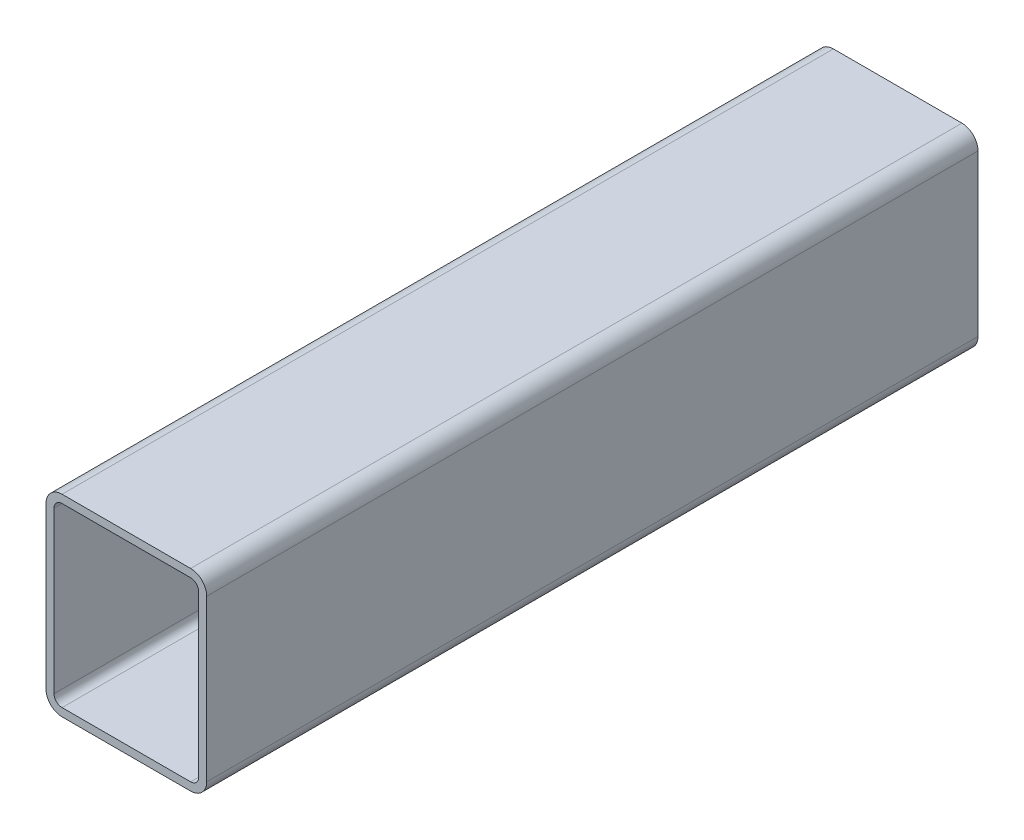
ISO-10303-21;
HEADER;
FILE_DESCRIPTION(('STEP AP214'),'2;1');
FILE_NAME('part.step','',(''),(''),'','','');
FILE_SCHEMA(('AUTOMOTIVE_DESIGN { 1 0 10303 214 1 1 1 1 }'));
ENDSEC;
DATA;
#1=APPLICATION_CONTEXT('core data for automotive mechanical design processes');
#2=APPLICATION_PROTOCOL_DEFINITION('international standard','automotive_design',2000,#1);
#3=PRODUCT_CONTEXT('',#1,'mechanical');
#4=PRODUCT('Part','Part','',(#3));
#5=PRODUCT_RELATED_PRODUCT_CATEGORY('part','',(#4));
#6=PRODUCT_DEFINITION_FORMATION('','',#4);
#7=PRODUCT_DEFINITION_CONTEXT('part definition',#1,'design');
#8=PRODUCT_DEFINITION('design','',#6,#7);
#9=PRODUCT_DEFINITION_SHAPE('','',#8);
#10=(LENGTH_UNIT() NAMED_UNIT(*) SI_UNIT(.MILLI.,.METRE.));
#11=(NAMED_UNIT(*) PLANE_ANGLE_UNIT() SI_UNIT($,.RADIAN.));
#12=(NAMED_UNIT(*) SI_UNIT($,.STERADIAN.) SOLID_ANGLE_UNIT());
#13=UNCERTAINTY_MEASURE_WITH_UNIT(LENGTH_MEASURE(1.E-05),#10,'distance_accuracy_value','');
#14=(GEOMETRIC_REPRESENTATION_CONTEXT(3) GLOBAL_UNCERTAINTY_ASSIGNED_CONTEXT((#13)) GLOBAL_UNIT_ASSIGNED_CONTEXT((#10,
#11,#12)) REPRESENTATION_CONTEXT('',''));
#15=CARTESIAN_POINT('',(0.,0.,0.));
#16=DIRECTION('',(0.,0.,1.));
#17=DIRECTION('',(1.,0.,0.));
#18=AXIS2_PLACEMENT_3D('',#15,#16,#17);
#19=CARTESIAN_POINT('',(9.24608514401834,71.9306737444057,304.8));
#20=DIRECTION('',(0.,0.,1.));
#21=DIRECTION('',(1.,0.,0.));
#22=AXIS2_PLACEMENT_3D('',#19,#20,#21);
#23=PLANE('',#22);
#24=CARTESIAN_POINT('',(9.24608514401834,71.9306737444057,304.8));
#25=DIRECTION('',(0.,0.,1.));
#26=DIRECTION('',(1.,0.,0.));
#27=AXIS2_PLACEMENT_3D('',#24,#25,#26);
#28=CIRCLE('',#27,6.35);
#29=CARTESIAN_POINT('',(9.24608514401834,78.2806737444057,304.8));
#30=VERTEX_POINT('',#29);
#31=CARTESIAN_POINT('',(2.89608514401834,71.9306737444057,304.8));
#32=VERTEX_POINT('',#31);
#33=EDGE_CURVE('E211',#30,#32,#28,.T.);
#34=ORIENTED_EDGE('',*,*,#33,.T.);
#35=DIRECTION('',(0.,-1.,0.));
#36=VECTOR('',#35,1.);
#37=CARTESIAN_POINT('',(2.89608514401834,8.4306737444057,304.8));
#38=LINE('',#37,#36);
#39=CARTESIAN_POINT('',(2.89608514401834,8.4306737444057,304.8));
#40=VERTEX_POINT('',#39);
#41=EDGE_CURVE('E214',#32,#40,#38,.T.);
#42=ORIENTED_EDGE('',*,*,#41,.T.);
#43=CARTESIAN_POINT('',(9.24608514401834,8.4306737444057,304.8));
#44=DIRECTION('',(0.,0.,1.));
#45=DIRECTION('',(1.,0.,0.));
#46=AXIS2_PLACEMENT_3D('',#43,#44,#45);
#47=CIRCLE('',#46,6.35);
#48=CARTESIAN_POINT('',(9.24608514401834,2.0806737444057,304.8));
#49=VERTEX_POINT('',#48);
#50=EDGE_CURVE('E217',#40,#49,#47,.T.);
#51=ORIENTED_EDGE('',*,*,#50,.T.);
#52=DIRECTION('',(1.,0.,0.));
#53=VECTOR('',#52,1.);
#54=CARTESIAN_POINT('',(60.0460851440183,2.0806737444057,304.8));
#55=LINE('',#54,#53);
#56=CARTESIAN_POINT('',(60.0460851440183,2.0806737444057,304.8));
#57=VERTEX_POINT('',#56);
#58=EDGE_CURVE('E219',#49,#57,#55,.T.);
#59=ORIENTED_EDGE('',*,*,#58,.T.);
#60=CARTESIAN_POINT('',(60.0460851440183,8.4306737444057,304.8));
#61=DIRECTION('',(0.,0.,1.));
#62=DIRECTION('',(1.,0.,0.));
#63=AXIS2_PLACEMENT_3D('',#60,#61,#62);
#64=CIRCLE('',#63,6.35);
#65=CARTESIAN_POINT('',(66.3960851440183,8.4306737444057,304.8));
#66=VERTEX_POINT('',#65);
#67=EDGE_CURVE('E221',#57,#66,#64,.T.);
#68=ORIENTED_EDGE('',*,*,#67,.T.);
#69=DIRECTION('',(0.,1.,0.));
#70=VECTOR('',#69,1.);
#71=CARTESIAN_POINT('',(66.3960851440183,71.9306737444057,304.8));
#72=LINE('',#71,#70);
#73=CARTESIAN_POINT('',(66.3960851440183,71.9306737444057,304.8));
#74=VERTEX_POINT('',#73);
#75=EDGE_CURVE('E223',#66,#74,#72,.T.);
#76=ORIENTED_EDGE('',*,*,#75,.T.);
#77=CARTESIAN_POINT('',(60.0460851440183,71.9306737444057,304.8));
#78=DIRECTION('',(0.,0.,1.));
#79=DIRECTION('',(1.,0.,0.));
#80=AXIS2_PLACEMENT_3D('',#77,#78,#79);
#81=CIRCLE('',#80,6.35);
#82=CARTESIAN_POINT('',(60.0460851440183,78.2806737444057,304.8));
#83=VERTEX_POINT('',#82);
#84=EDGE_CURVE('E225',#74,#83,#81,.T.);
#85=ORIENTED_EDGE('',*,*,#84,.T.);
#86=DIRECTION('',(-1.,0.,0.));
#87=VECTOR('',#86,1.);
#88=CARTESIAN_POINT('',(9.24608514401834,78.2806737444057,304.8));
#89=LINE('',#88,#87);
#90=EDGE_CURVE('E227',#83,#30,#89,.T.);
#91=ORIENTED_EDGE('',*,*,#90,.T.);
#92=EDGE_LOOP('',(#34,#42,#51,#59,#68,#76,#85,#91));
#93=FACE_BOUND('',#92,.T.);
#94=DIRECTION('',(0.,-1.,0.));
#95=VECTOR('',#94,1.);
#96=CARTESIAN_POINT('',(6.07108514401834,8.4306737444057,304.8));
#97=LINE('',#96,#95);
#98=CARTESIAN_POINT('',(6.07108514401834,71.9306737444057,304.8));
#99=VERTEX_POINT('',#98);
#100=CARTESIAN_POINT('',(6.07108514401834,8.4306737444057,304.8));
#101=VERTEX_POINT('',#100);
#102=EDGE_CURVE('E154',#99,#101,#97,.T.);
#103=ORIENTED_EDGE('',*,*,#102,.F.);
#104=CARTESIAN_POINT('',(9.24608514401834,71.9306737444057,304.8));
#105=DIRECTION('',(0.,0.,1.));
#106=DIRECTION('',(1.,0.,0.));
#107=AXIS2_PLACEMENT_3D('',#104,#105,#106);
#108=CIRCLE('',#107,3.175);
#109=CARTESIAN_POINT('',(9.24608514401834,75.1056737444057,304.8));
#110=VERTEX_POINT('',#109);
#111=EDGE_CURVE('E146',#110,#99,#108,.T.);
#112=ORIENTED_EDGE('',*,*,#111,.F.);
#113=DIRECTION('',(-1.,0.,0.));
#114=VECTOR('',#113,1.);
#115=CARTESIAN_POINT('',(9.24608514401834,75.1056737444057,304.8));
#116=LINE('',#115,#114);
#117=CARTESIAN_POINT('',(60.0460851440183,75.1056737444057,304.8));
#118=VERTEX_POINT('',#117);
#119=EDGE_CURVE('E179',#118,#110,#116,.T.);
#120=ORIENTED_EDGE('',*,*,#119,.F.);
#121=CARTESIAN_POINT('',(60.0460851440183,71.9306737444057,304.8));
#122=DIRECTION('',(0.,0.,1.));
#123=DIRECTION('',(1.,0.,0.));
#124=AXIS2_PLACEMENT_3D('',#121,#122,#123);
#125=CIRCLE('',#124,3.175);
#126=CARTESIAN_POINT('',(63.2210851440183,71.9306737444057,304.8));
#127=VERTEX_POINT('',#126);
#128=EDGE_CURVE('E177',#127,#118,#125,.T.);
#129=ORIENTED_EDGE('',*,*,#128,.F.);
#130=DIRECTION('',(0.,1.,0.));
#131=VECTOR('',#130,1.);
#132=CARTESIAN_POINT('',(63.2210851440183,71.9306737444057,304.8));
#133=LINE('',#132,#131);
#134=CARTESIAN_POINT('',(63.2210851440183,8.4306737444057,304.8));
#135=VERTEX_POINT('',#134);
#136=EDGE_CURVE('E175',#135,#127,#133,.T.);
#137=ORIENTED_EDGE('',*,*,#136,.F.);
#138=CARTESIAN_POINT('',(60.0460851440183,8.4306737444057,304.8));
#139=DIRECTION('',(0.,0.,1.));
#140=DIRECTION('',(1.,0.,0.));
#141=AXIS2_PLACEMENT_3D('',#138,#139,#140);
#142=CIRCLE('',#141,3.175);
#143=CARTESIAN_POINT('',(60.0460851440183,5.2556737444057,304.8));
#144=VERTEX_POINT('',#143);
#145=EDGE_CURVE('E173',#144,#135,#142,.T.);
#146=ORIENTED_EDGE('',*,*,#145,.F.);
#147=DIRECTION('',(1.,0.,0.));
#148=VECTOR('',#147,1.);
#149=CARTESIAN_POINT('',(60.0460851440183,5.2556737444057,304.8));
#150=LINE('',#149,#148);
#151=CARTESIAN_POINT('',(9.24608514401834,5.2556737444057,304.8));
#152=VERTEX_POINT('',#151);
#153=EDGE_CURVE('E169',#152,#144,#150,.T.);
#154=ORIENTED_EDGE('',*,*,#153,.F.);
#155=CARTESIAN_POINT('',(9.24608514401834,8.4306737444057,304.8));
#156=DIRECTION('',(0.,0.,1.));
#157=DIRECTION('',(1.,0.,0.));
#158=AXIS2_PLACEMENT_3D('',#155,#156,#157);
#159=CIRCLE('',#158,3.175);
#160=EDGE_CURVE('E167',#101,#152,#159,.T.);
#161=ORIENTED_EDGE('',*,*,#160,.F.);
#162=EDGE_LOOP('',(#103,#112,#120,#129,#137,#146,#154,#161));
#163=FACE_BOUND('',#162,.T.);
#164=ADVANCED_FACE('F33',(#93,#163),#23,.T.);
#165=CARTESIAN_POINT('',(9.24608514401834,71.9306737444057,0.));
#166=DIRECTION('',(0.,0.,1.));
#167=DIRECTION('',(1.,0.,0.));
#168=AXIS2_PLACEMENT_3D('',#165,#166,#167);
#169=PLANE('',#168);
#170=CARTESIAN_POINT('',(9.24608514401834,71.9306737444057,0.));
#171=DIRECTION('',(0.,0.,1.));
#172=DIRECTION('',(1.,0.,0.));
#173=AXIS2_PLACEMENT_3D('',#170,#171,#172);
#174=CIRCLE('',#173,6.35);
#175=CARTESIAN_POINT('',(9.24608514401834,78.2806737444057,0.));
#176=VERTEX_POINT('',#175);
#177=CARTESIAN_POINT('',(2.89608514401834,71.9306737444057,0.));
#178=VERTEX_POINT('',#177);
#179=EDGE_CURVE('E162',#176,#178,#174,.T.);
#180=ORIENTED_EDGE('',*,*,#179,.F.);
#181=DIRECTION('',(-1.,0.,0.));
#182=VECTOR('',#181,1.);
#183=CARTESIAN_POINT('',(9.24608514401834,78.2806737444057,0.));
#184=LINE('',#183,#182);
#185=CARTESIAN_POINT('',(60.0460851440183,78.2806737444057,0.));
#186=VERTEX_POINT('',#185);
#187=EDGE_CURVE('E215',#186,#176,#184,.T.);
#188=ORIENTED_EDGE('',*,*,#187,.F.);
#189=CARTESIAN_POINT('',(60.0460851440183,71.9306737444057,0.));
#190=DIRECTION('',(0.,0.,1.));
#191=DIRECTION('',(1.,0.,0.));
#192=AXIS2_PLACEMENT_3D('',#189,#190,#191);
#193=CIRCLE('',#192,6.35);
#194=CARTESIAN_POINT('',(66.3960851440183,71.9306737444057,0.));
#195=VERTEX_POINT('',#194);
#196=EDGE_CURVE('E242',#195,#186,#193,.T.);
#197=ORIENTED_EDGE('',*,*,#196,.F.);
#198=DIRECTION('',(0.,1.,0.));
#199=VECTOR('',#198,1.);
#200=CARTESIAN_POINT('',(66.3960851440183,71.9306737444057,0.));
#201=LINE('',#200,#199);
#202=CARTESIAN_POINT('',(66.3960851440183,8.4306737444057,0.));
#203=VERTEX_POINT('',#202);
#204=EDGE_CURVE('E240',#203,#195,#201,.T.);
#205=ORIENTED_EDGE('',*,*,#204,.F.);
#206=CARTESIAN_POINT('',(60.0460851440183,8.4306737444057,0.));
#207=DIRECTION('',(0.,0.,1.));
#208=DIRECTION('',(1.,0.,0.));
#209=AXIS2_PLACEMENT_3D('',#206,#207,#208);
#210=CIRCLE('',#209,6.35);
#211=CARTESIAN_POINT('',(60.0460851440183,2.0806737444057,0.));
#212=VERTEX_POINT('',#211);
#213=EDGE_CURVE('E238',#212,#203,#210,.T.);
#214=ORIENTED_EDGE('',*,*,#213,.F.);
#215=DIRECTION('',(1.,0.,0.));
#216=VECTOR('',#215,1.);
#217=CARTESIAN_POINT('',(60.0460851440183,2.0806737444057,0.));
#218=LINE('',#217,#216);
#219=CARTESIAN_POINT('',(9.24608514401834,2.0806737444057,0.));
#220=VERTEX_POINT('',#219);
#221=EDGE_CURVE('E236',#220,#212,#218,.T.);
#222=ORIENTED_EDGE('',*,*,#221,.F.);
#223=CARTESIAN_POINT('',(9.24608514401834,8.4306737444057,0.));
#224=DIRECTION('',(0.,0.,1.));
#225=DIRECTION('',(1.,0.,0.));
#226=AXIS2_PLACEMENT_3D('',#223,#224,#225);
#227=CIRCLE('',#226,6.35);
#228=CARTESIAN_POINT('',(2.89608514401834,8.4306737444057,0.));
#229=VERTEX_POINT('',#228);
#230=EDGE_CURVE('E234',#229,#220,#227,.T.);
#231=ORIENTED_EDGE('',*,*,#230,.F.);
#232=DIRECTION('',(0.,-1.,0.));
#233=VECTOR('',#232,1.);
#234=CARTESIAN_POINT('',(2.89608514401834,8.4306737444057,0.));
#235=LINE('',#234,#233);
#236=EDGE_CURVE('E232',#178,#229,#235,.T.);
#237=ORIENTED_EDGE('',*,*,#236,.F.);
#238=EDGE_LOOP('',(#180,#188,#197,#205,#214,#222,#231,#237));
#239=FACE_BOUND('',#238,.T.);
#240=CARTESIAN_POINT('',(9.24608514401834,71.9306737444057,0.));
#241=DIRECTION('',(0.,0.,1.));
#242=DIRECTION('',(1.,0.,0.));
#243=AXIS2_PLACEMENT_3D('',#240,#241,#242);
#244=CIRCLE('',#243,3.175);
#245=CARTESIAN_POINT('',(9.24608514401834,75.1056737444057,0.));
#246=VERTEX_POINT('',#245);
#247=CARTESIAN_POINT('',(6.07108514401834,71.9306737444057,0.));
#248=VERTEX_POINT('',#247);
#249=EDGE_CURVE('E56',#246,#248,#244,.T.);
#250=ORIENTED_EDGE('',*,*,#249,.T.);
#251=DIRECTION('',(0.,-1.,0.));
#252=VECTOR('',#251,1.);
#253=CARTESIAN_POINT('',(6.07108514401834,8.4306737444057,0.));
#254=LINE('',#253,#252);
#255=CARTESIAN_POINT('',(6.07108514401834,8.4306737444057,0.));
#256=VERTEX_POINT('',#255);
#257=EDGE_CURVE('E161',#248,#256,#254,.T.);
#258=ORIENTED_EDGE('',*,*,#257,.T.);
#259=CARTESIAN_POINT('',(9.24608514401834,8.4306737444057,0.));
#260=DIRECTION('',(0.,0.,1.));
#261=DIRECTION('',(1.,0.,0.));
#262=AXIS2_PLACEMENT_3D('',#259,#260,#261);
#263=CIRCLE('',#262,3.175);
#264=CARTESIAN_POINT('',(9.24608514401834,5.2556737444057,0.));
#265=VERTEX_POINT('',#264);
#266=EDGE_CURVE('E183',#256,#265,#263,.T.);
#267=ORIENTED_EDGE('',*,*,#266,.T.);
#268=DIRECTION('',(1.,0.,0.));
#269=VECTOR('',#268,1.);
#270=CARTESIAN_POINT('',(60.0460851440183,5.2556737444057,0.));
#271=LINE('',#270,#269);
#272=CARTESIAN_POINT('',(60.0460851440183,5.2556737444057,0.));
#273=VERTEX_POINT('',#272);
#274=EDGE_CURVE('E186',#265,#273,#271,.T.);
#275=ORIENTED_EDGE('',*,*,#274,.T.);
#276=CARTESIAN_POINT('',(60.0460851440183,8.4306737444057,0.));
#277=DIRECTION('',(0.,0.,1.));
#278=DIRECTION('',(1.,0.,0.));
#279=AXIS2_PLACEMENT_3D('',#276,#277,#278);
#280=CIRCLE('',#279,3.175);
#281=CARTESIAN_POINT('',(63.2210851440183,8.4306737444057,0.));
#282=VERTEX_POINT('',#281);
#283=EDGE_CURVE('E189',#273,#282,#280,.T.);
#284=ORIENTED_EDGE('',*,*,#283,.T.);
#285=DIRECTION('',(0.,1.,0.));
#286=VECTOR('',#285,1.);
#287=CARTESIAN_POINT('',(63.2210851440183,71.9306737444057,0.));
#288=LINE('',#287,#286);
#289=CARTESIAN_POINT('',(63.2210851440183,71.9306737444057,0.));
#290=VERTEX_POINT('',#289);
#291=EDGE_CURVE('E192',#282,#290,#288,.T.);
#292=ORIENTED_EDGE('',*,*,#291,.T.);
#293=CARTESIAN_POINT('',(60.0460851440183,71.9306737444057,0.));
#294=DIRECTION('',(0.,0.,1.));
#295=DIRECTION('',(1.,0.,0.));
#296=AXIS2_PLACEMENT_3D('',#293,#294,#295);
#297=CIRCLE('',#296,3.175);
#298=CARTESIAN_POINT('',(60.0460851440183,75.1056737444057,0.));
#299=VERTEX_POINT('',#298);
#300=EDGE_CURVE('E195',#290,#299,#297,.T.);
#301=ORIENTED_EDGE('',*,*,#300,.T.);
#302=DIRECTION('',(-1.,0.,0.));
#303=VECTOR('',#302,1.);
#304=CARTESIAN_POINT('',(9.24608514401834,75.1056737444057,0.));
#305=LINE('',#304,#303);
#306=EDGE_CURVE('E155',#299,#246,#305,.T.);
#307=ORIENTED_EDGE('',*,*,#306,.T.);
#308=EDGE_LOOP('',(#250,#258,#267,#275,#284,#292,#301,#307));
#309=FACE_BOUND('',#308,.T.);
#310=ADVANCED_FACE('F272',(#239,#309),#169,.F.);
#311=CARTESIAN_POINT('',(9.24608514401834,71.9306737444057,304.8));
#312=DIRECTION('',(0.,0.,-1.));
#313=DIRECTION('',(-1.,0.,0.));
#314=AXIS2_PLACEMENT_3D('',#311,#312,#313);
#315=CYLINDRICAL_SURFACE('',#314,6.35);
#316=ORIENTED_EDGE('',*,*,#179,.T.);
#317=DIRECTION('',(0.,0.,-1.));
#318=VECTOR('',#317,1.);
#319=CARTESIAN_POINT('',(2.89608514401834,71.9306737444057,304.8));
#320=LINE('',#319,#318);
#321=EDGE_CURVE('E11',#32,#178,#320,.T.);
#322=ORIENTED_EDGE('',*,*,#321,.F.);
#323=ORIENTED_EDGE('',*,*,#33,.F.);
#324=DIRECTION('',(0.,0.,-1.));
#325=VECTOR('',#324,1.);
#326=CARTESIAN_POINT('',(9.24608514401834,78.2806737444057,304.8));
#327=LINE('',#326,#325);
#328=EDGE_CURVE('E229',#30,#176,#327,.T.);
#329=ORIENTED_EDGE('',*,*,#328,.T.);
#330=EDGE_LOOP('',(#316,#322,#323,#329));
#331=FACE_BOUND('',#330,.T.);
#332=ADVANCED_FACE('F35',(#331),#315,.T.);
#333=CARTESIAN_POINT('',(2.89608514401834,8.4306737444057,304.8));
#334=DIRECTION('',(1.,0.,0.));
#335=DIRECTION('',(0.,0.,-1.));
#336=AXIS2_PLACEMENT_3D('',#333,#334,#335);
#337=PLANE('',#336);
#338=ORIENTED_EDGE('',*,*,#236,.T.);
#339=DIRECTION('',(0.,0.,-1.));
#340=VECTOR('',#339,1.);
#341=CARTESIAN_POINT('',(2.89608514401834,8.4306737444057,304.8));
#342=LINE('',#341,#340);
#343=EDGE_CURVE('E41',#40,#229,#342,.T.);
#344=ORIENTED_EDGE('',*,*,#343,.F.);
#345=ORIENTED_EDGE('',*,*,#41,.F.);
#346=ORIENTED_EDGE('',*,*,#321,.T.);
#347=EDGE_LOOP('',(#338,#344,#345,#346));
#348=FACE_BOUND('',#347,.T.);
#349=ADVANCED_FACE('F289',(#348),#337,.F.);
#350=CARTESIAN_POINT('',(9.24608514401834,8.4306737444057,304.8));
#351=DIRECTION('',(0.,0.,-1.));
#352=DIRECTION('',(-1.,0.,0.));
#353=AXIS2_PLACEMENT_3D('',#350,#351,#352);
#354=CYLINDRICAL_SURFACE('',#353,6.35);
#355=ORIENTED_EDGE('',*,*,#230,.T.);
#356=DIRECTION('',(0.,0.,-1.));
#357=VECTOR('',#356,1.);
#358=CARTESIAN_POINT('',(9.24608514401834,2.0806737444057,304.8));
#359=LINE('',#358,#357);
#360=EDGE_CURVE('E259',#49,#220,#359,.T.);
#361=ORIENTED_EDGE('',*,*,#360,.F.);
#362=ORIENTED_EDGE('',*,*,#50,.F.);
#363=ORIENTED_EDGE('',*,*,#343,.T.);
#364=EDGE_LOOP('',(#355,#361,#362,#363));
#365=FACE_BOUND('',#364,.T.);
#366=ADVANCED_FACE('F266',(#365),#354,.T.);
#367=CARTESIAN_POINT('',(60.0460851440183,2.0806737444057,304.8));
#368=DIRECTION('',(0.,1.,0.));
#369=DIRECTION('',(0.,0.,1.));
#370=AXIS2_PLACEMENT_3D('',#367,#368,#369);
#371=PLANE('',#370);
#372=ORIENTED_EDGE('',*,*,#221,.T.);
#373=DIRECTION('',(0.,0.,-1.));
#374=VECTOR('',#373,1.);
#375=CARTESIAN_POINT('',(60.0460851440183,2.0806737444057,304.8));
#376=LINE('',#375,#374);
#377=EDGE_CURVE('E256',#57,#212,#376,.T.);
#378=ORIENTED_EDGE('',*,*,#377,.F.);
#379=ORIENTED_EDGE('',*,*,#58,.F.);
#380=ORIENTED_EDGE('',*,*,#360,.T.);
#381=EDGE_LOOP('',(#372,#378,#379,#380));
#382=FACE_BOUND('',#381,.T.);
#383=ADVANCED_FACE('F278',(#382),#371,.F.);
#384=CARTESIAN_POINT('',(60.0460851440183,8.4306737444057,304.8));
#385=DIRECTION('',(0.,0.,-1.));
#386=DIRECTION('',(-1.,0.,0.));
#387=AXIS2_PLACEMENT_3D('',#384,#385,#386);
#388=CYLINDRICAL_SURFACE('',#387,6.35);
#389=ORIENTED_EDGE('',*,*,#213,.T.);
#390=DIRECTION('',(0.,0.,-1.));
#391=VECTOR('',#390,1.);
#392=CARTESIAN_POINT('',(66.3960851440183,8.4306737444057,304.8));
#393=LINE('',#392,#391);
#394=EDGE_CURVE('E253',#66,#203,#393,.T.);
#395=ORIENTED_EDGE('',*,*,#394,.F.);
#396=ORIENTED_EDGE('',*,*,#67,.F.);
#397=ORIENTED_EDGE('',*,*,#377,.T.);
#398=EDGE_LOOP('',(#389,#395,#396,#397));
#399=FACE_BOUND('',#398,.T.);
#400=ADVANCED_FACE('F282',(#399),#388,.T.);
#401=CARTESIAN_POINT('',(66.3960851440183,71.9306737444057,304.8));
#402=DIRECTION('',(-1.,0.,0.));
#403=DIRECTION('',(0.,0.,1.));
#404=AXIS2_PLACEMENT_3D('',#401,#402,#403);
#405=PLANE('',#404);
#406=ORIENTED_EDGE('',*,*,#204,.T.);
#407=DIRECTION('',(0.,0.,-1.));
#408=VECTOR('',#407,1.);
#409=CARTESIAN_POINT('',(66.3960851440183,71.9306737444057,304.8));
#410=LINE('',#409,#408);
#411=EDGE_CURVE('E250',#74,#195,#410,.T.);
#412=ORIENTED_EDGE('',*,*,#411,.F.);
#413=ORIENTED_EDGE('',*,*,#75,.F.);
#414=ORIENTED_EDGE('',*,*,#394,.T.);
#415=EDGE_LOOP('',(#406,#412,#413,#414));
#416=FACE_BOUND('',#415,.T.);
#417=ADVANCED_FACE('F302',(#416),#405,.F.);
#418=CARTESIAN_POINT('',(60.0460851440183,71.9306737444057,304.8));
#419=DIRECTION('',(0.,0.,-1.));
#420=DIRECTION('',(-1.,0.,0.));
#421=AXIS2_PLACEMENT_3D('',#418,#419,#420);
#422=CYLINDRICAL_SURFACE('',#421,6.35);
#423=ORIENTED_EDGE('',*,*,#196,.T.);
#424=DIRECTION('',(0.,0.,-1.));
#425=VECTOR('',#424,1.);
#426=CARTESIAN_POINT('',(60.0460851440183,78.2806737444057,304.8));
#427=LINE('',#426,#425);
#428=EDGE_CURVE('E247',#83,#186,#427,.T.);
#429=ORIENTED_EDGE('',*,*,#428,.F.);
#430=ORIENTED_EDGE('',*,*,#84,.F.);
#431=ORIENTED_EDGE('',*,*,#411,.T.);
#432=EDGE_LOOP('',(#423,#429,#430,#431));
#433=FACE_BOUND('',#432,.T.);
#434=ADVANCED_FACE('F300',(#433),#422,.T.);
#435=CARTESIAN_POINT('',(9.24608514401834,78.2806737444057,304.8));
#436=DIRECTION('',(0.,-1.,0.));
#437=DIRECTION('',(0.,0.,-1.));
#438=AXIS2_PLACEMENT_3D('',#435,#436,#437);
#439=PLANE('',#438);
#440=ORIENTED_EDGE('',*,*,#187,.T.);
#441=ORIENTED_EDGE('',*,*,#328,.F.);
#442=ORIENTED_EDGE('',*,*,#90,.F.);
#443=ORIENTED_EDGE('',*,*,#428,.T.);
#444=EDGE_LOOP('',(#440,#441,#442,#443));
#445=FACE_BOUND('',#444,.T.);
#446=ADVANCED_FACE('F295',(#445),#439,.F.);
#447=CARTESIAN_POINT('',(9.24608514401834,71.9306737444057,304.8));
#448=DIRECTION('',(0.,0.,-1.));
#449=DIRECTION('',(-1.,0.,0.));
#450=AXIS2_PLACEMENT_3D('',#447,#448,#449);
#451=CYLINDRICAL_SURFACE('',#450,3.175);
#452=ORIENTED_EDGE('',*,*,#249,.F.);
#453=DIRECTION('',(0.,0.,-1.));
#454=VECTOR('',#453,1.);
#455=CARTESIAN_POINT('',(9.24608514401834,75.1056737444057,304.8));
#456=LINE('',#455,#454);
#457=EDGE_CURVE('E150',#110,#246,#456,.T.);
#458=ORIENTED_EDGE('',*,*,#457,.F.);
#459=ORIENTED_EDGE('',*,*,#111,.T.);
#460=DIRECTION('',(0.,0.,-1.));
#461=VECTOR('',#460,1.);
#462=CARTESIAN_POINT('',(6.07108514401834,71.9306737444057,304.8));
#463=LINE('',#462,#461);
#464=EDGE_CURVE('E149',#99,#248,#463,.T.);
#465=ORIENTED_EDGE('',*,*,#464,.T.);
#466=EDGE_LOOP('',(#452,#458,#459,#465));
#467=FACE_BOUND('',#466,.T.);
#468=ADVANCED_FACE('F148',(#467),#451,.F.);
#469=CARTESIAN_POINT('',(6.07108514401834,8.4306737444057,304.8));
#470=DIRECTION('',(1.,0.,0.));
#471=DIRECTION('',(0.,0.,-1.));
#472=AXIS2_PLACEMENT_3D('',#469,#470,#471);
#473=PLANE('',#472);
#474=ORIENTED_EDGE('',*,*,#257,.F.);
#475=ORIENTED_EDGE('',*,*,#464,.F.);
#476=ORIENTED_EDGE('',*,*,#102,.T.);
#477=DIRECTION('',(0.,0.,-1.));
#478=VECTOR('',#477,1.);
#479=CARTESIAN_POINT('',(6.07108514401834,8.4306737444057,304.8));
#480=LINE('',#479,#478);
#481=EDGE_CURVE('E163',#101,#256,#480,.T.);
#482=ORIENTED_EDGE('',*,*,#481,.T.);
#483=EDGE_LOOP('',(#474,#475,#476,#482));
#484=FACE_BOUND('',#483,.T.);
#485=ADVANCED_FACE('F158',(#484),#473,.T.);
#486=CARTESIAN_POINT('',(9.24608514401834,8.4306737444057,304.8));
#487=DIRECTION('',(0.,0.,-1.));
#488=DIRECTION('',(-1.,0.,0.));
#489=AXIS2_PLACEMENT_3D('',#486,#487,#488);
#490=CYLINDRICAL_SURFACE('',#489,3.175);
#491=ORIENTED_EDGE('',*,*,#266,.F.);
#492=ORIENTED_EDGE('',*,*,#481,.F.);
#493=ORIENTED_EDGE('',*,*,#160,.T.);
#494=DIRECTION('',(0.,0.,-1.));
#495=VECTOR('',#494,1.);
#496=CARTESIAN_POINT('',(9.24608514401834,5.2556737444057,304.8));
#497=LINE('',#496,#495);
#498=EDGE_CURVE('E208',#152,#265,#497,.T.);
#499=ORIENTED_EDGE('',*,*,#498,.T.);
#500=EDGE_LOOP('',(#491,#492,#493,#499));
#501=FACE_BOUND('',#500,.T.);
#502=ADVANCED_FACE('F327',(#501),#490,.F.);
#503=CARTESIAN_POINT('',(60.0460851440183,5.2556737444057,304.8));
#504=DIRECTION('',(0.,1.,0.));
#505=DIRECTION('',(0.,0.,1.));
#506=AXIS2_PLACEMENT_3D('',#503,#504,#505);
#507=PLANE('',#506);
#508=ORIENTED_EDGE('',*,*,#274,.F.);
#509=ORIENTED_EDGE('',*,*,#498,.F.);
#510=ORIENTED_EDGE('',*,*,#153,.T.);
#511=DIRECTION('',(0.,0.,-1.));
#512=VECTOR('',#511,1.);
#513=CARTESIAN_POINT('',(60.0460851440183,5.2556737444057,304.8));
#514=LINE('',#513,#512);
#515=EDGE_CURVE('E206',#144,#273,#514,.T.);
#516=ORIENTED_EDGE('',*,*,#515,.T.);
#517=EDGE_LOOP('',(#508,#509,#510,#516));
#518=FACE_BOUND('',#517,.T.);
#519=ADVANCED_FACE('F331',(#518),#507,.T.);
#520=CARTESIAN_POINT('',(60.0460851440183,8.4306737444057,304.8));
#521=DIRECTION('',(0.,0.,-1.));
#522=DIRECTION('',(-1.,0.,0.));
#523=AXIS2_PLACEMENT_3D('',#520,#521,#522);
#524=CYLINDRICAL_SURFACE('',#523,3.175);
#525=ORIENTED_EDGE('',*,*,#283,.F.);
#526=ORIENTED_EDGE('',*,*,#515,.F.);
#527=ORIENTED_EDGE('',*,*,#145,.T.);
#528=DIRECTION('',(0.,0.,-1.));
#529=VECTOR('',#528,1.);
#530=CARTESIAN_POINT('',(63.2210851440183,8.4306737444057,304.8));
#531=LINE('',#530,#529);
#532=EDGE_CURVE('E204',#135,#282,#531,.T.);
#533=ORIENTED_EDGE('',*,*,#532,.T.);
#534=EDGE_LOOP('',(#525,#526,#527,#533));
#535=FACE_BOUND('',#534,.T.);
#536=ADVANCED_FACE('F337',(#535),#524,.F.);
#537=CARTESIAN_POINT('',(63.2210851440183,71.9306737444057,304.8));
#538=DIRECTION('',(-1.,0.,0.));
#539=DIRECTION('',(0.,0.,1.));
#540=AXIS2_PLACEMENT_3D('',#537,#538,#539);
#541=PLANE('',#540);
#542=ORIENTED_EDGE('',*,*,#291,.F.);
#543=ORIENTED_EDGE('',*,*,#532,.F.);
#544=ORIENTED_EDGE('',*,*,#136,.T.);
#545=DIRECTION('',(0.,0.,-1.));
#546=VECTOR('',#545,1.);
#547=CARTESIAN_POINT('',(63.2210851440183,71.9306737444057,304.8));
#548=LINE('',#547,#546);
#549=EDGE_CURVE('E202',#127,#290,#548,.T.);
#550=ORIENTED_EDGE('',*,*,#549,.T.);
#551=EDGE_LOOP('',(#542,#543,#544,#550));
#552=FACE_BOUND('',#551,.T.);
#553=ADVANCED_FACE('F341',(#552),#541,.T.);
#554=CARTESIAN_POINT('',(60.0460851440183,71.9306737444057,304.8));
#555=DIRECTION('',(0.,0.,-1.));
#556=DIRECTION('',(-1.,0.,0.));
#557=AXIS2_PLACEMENT_3D('',#554,#555,#556);
#558=CYLINDRICAL_SURFACE('',#557,3.175);
#559=ORIENTED_EDGE('',*,*,#300,.F.);
#560=ORIENTED_EDGE('',*,*,#549,.F.);
#561=ORIENTED_EDGE('',*,*,#128,.T.);
#562=DIRECTION('',(0.,0.,-1.));
#563=VECTOR('',#562,1.);
#564=CARTESIAN_POINT('',(60.0460851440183,75.1056737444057,304.8));
#565=LINE('',#564,#563);
#566=EDGE_CURVE('E48',#118,#299,#565,.T.);
#567=ORIENTED_EDGE('',*,*,#566,.T.);
#568=EDGE_LOOP('',(#559,#560,#561,#567));
#569=FACE_BOUND('',#568,.T.);
#570=ADVANCED_FACE('F345',(#569),#558,.F.);
#571=CARTESIAN_POINT('',(9.24608514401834,75.1056737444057,304.8));
#572=DIRECTION('',(0.,-1.,0.));
#573=DIRECTION('',(0.,0.,-1.));
#574=AXIS2_PLACEMENT_3D('',#571,#572,#573);
#575=PLANE('',#574);
#576=ORIENTED_EDGE('',*,*,#306,.F.);
#577=ORIENTED_EDGE('',*,*,#566,.F.);
#578=ORIENTED_EDGE('',*,*,#119,.T.);
#579=ORIENTED_EDGE('',*,*,#457,.T.);
#580=EDGE_LOOP('',(#576,#577,#578,#579));
#581=FACE_BOUND('',#580,.T.);
#582=ADVANCED_FACE('F349',(#581),#575,.T.);
#583=CLOSED_SHELL('',(#164,#310,#332,#349,#366,#383,#400,#417,#434,#446,#468,#485,#502,#519,
#536,#553,#570,#582));
#584=MANIFOLD_SOLID_BREP('B2',#583);
#585=ADVANCED_BREP_SHAPE_REPRESENTATION('',(#18,#584),#14);
#586=SHAPE_DEFINITION_REPRESENTATION(#9,#585);
ENDSEC;
END-ISO-10303-21;
